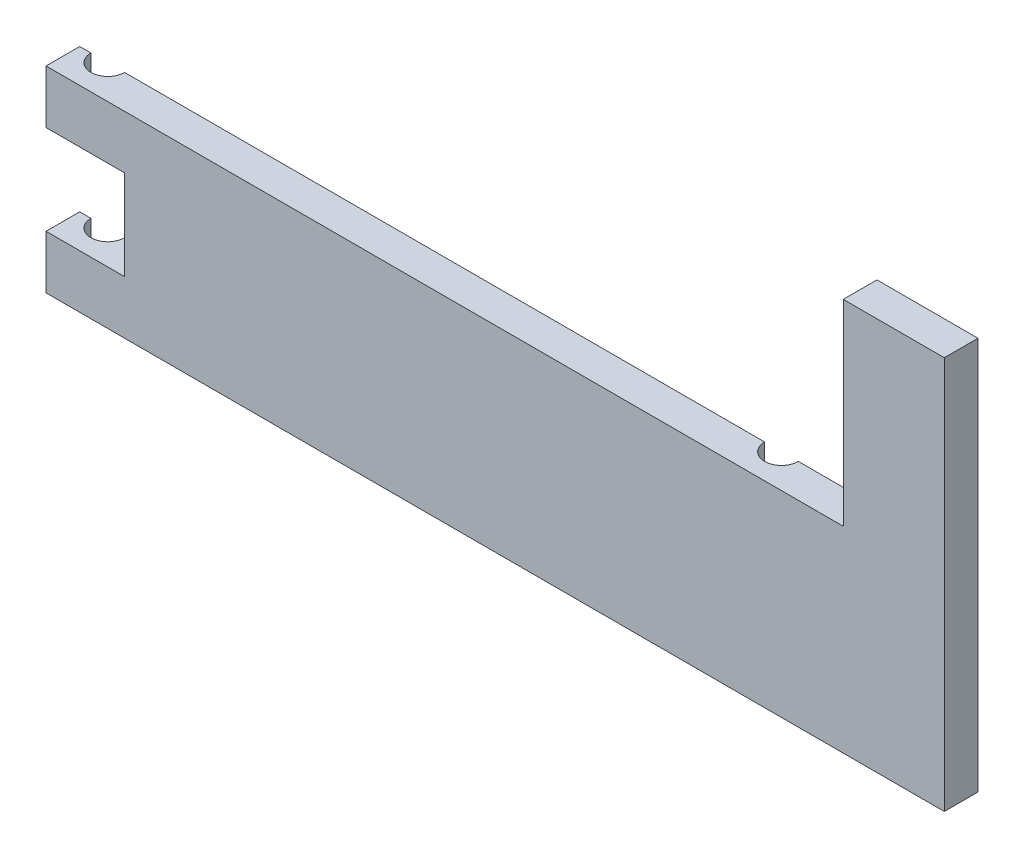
from build123d import *

# Parameters (mm, degrees)
EXTRUSION1_DEPTH        = 6
ESQUISSE2_R             = 3
ENL_V_MAT_EXTRU_1_DEPTH = 171.179317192


with BuildPart() as part:
    # Esquisse1 → Extrusion1 (new body)
    with BuildSketch(Plane.XY):
        Polygon((155, 70), (137, 70), (137, 35), (-5, 35), (-5, 25.5), (9, 25.5), (9, 9.5), (-5, 9.5), (-5, 0), (155, 0), align=None)
    extrude(amount=EXTRUSION1_DEPTH)

    # Esquisse2 → Enl_v. mat.-Extru.1 (cut, through all)
    with BuildSketch(Plane.XZ):
        Circle(ESQUISSE2_R)
        with Locations((120, 0)):
            Circle(ESQUISSE2_R)
    extrude(amount=-ENL_V_MAT_EXTRU_1_DEPTH, mode=Mode.SUBTRACT)


solid = part.part
